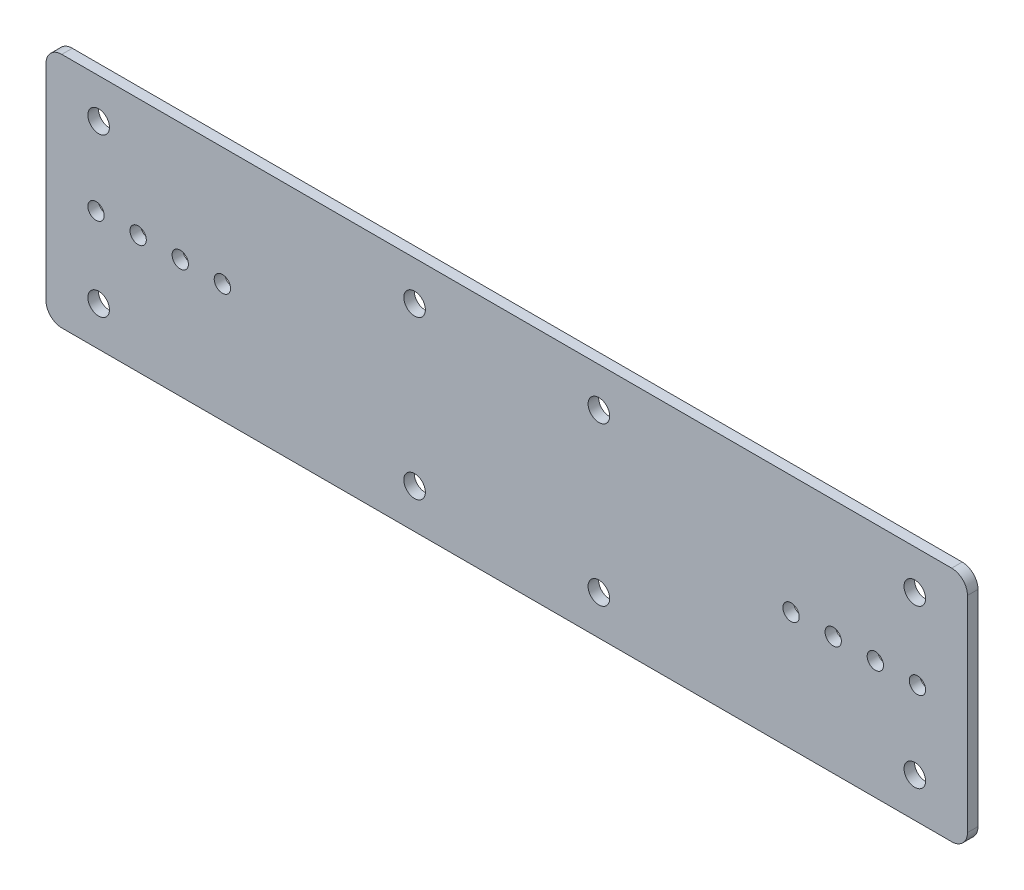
from build123d import *

# Parameters (mm, degrees)
SKETCH_1_W          = 320
SKETCH_1_H          = 45
SKETCH_1_R          = 2.05
EXTRUDE_1_DEPTH     = 2
SKETCH_3_W          = 356.595091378
SKETCH_3_H          = 107.344735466
SKETCH_3_W_2        = 175
SKETCH_3_H_2        = 45
CUT_EXTRUDE_1_DEPTH = 10
SKETCH_4_R          = 1.55
CUT_EXTRUDE_2_DEPTH = 10
FILLET_1_R          = 3


with BuildPart() as part:
    # Sketch 1 → Extrude 1 (new body)
    with BuildSketch(Plane.XY):
        Rectangle(SKETCH_1_W, SKETCH_1_H)
        with Locations((-17.5, 15)):
            Circle(SKETCH_1_R, mode=Mode.SUBTRACT)
        with Locations((17.5, 15)):
            Circle(SKETCH_1_R, mode=Mode.SUBTRACT)
        with Locations((17.5, -15)):
            Circle(SKETCH_1_R, mode=Mode.SUBTRACT)
        with Locations((-17.5, -15)):
            Circle(SKETCH_1_R, mode=Mode.SUBTRACT)
        with Locations((-150.5, 15)):
            Circle(SKETCH_1_R, mode=Mode.SUBTRACT)
        with Locations((-135.5, 15)):
            Circle(SKETCH_1_R, mode=Mode.SUBTRACT)
        with Locations((-135.5, -15)):
            Circle(SKETCH_1_R, mode=Mode.SUBTRACT)
        with Locations((-150.5, -15)):
            Circle(SKETCH_1_R, mode=Mode.SUBTRACT)
        with Locations(Location((150.5, 15, 0), (0, 0, 180))):
            Circle(SKETCH_1_R, mode=Mode.SUBTRACT)
        with Locations(Location((150.5, -15, 0), (0, 0, 180))):
            Circle(SKETCH_1_R, mode=Mode.SUBTRACT)
        with Locations(Location((135.5, -15, 0), (0, 0, 180))):
            Circle(SKETCH_1_R, mode=Mode.SUBTRACT)
        with Locations(Location((135.5, 15, 0), (0, 0, 180))):
            Circle(SKETCH_1_R, mode=Mode.SUBTRACT)
        with Locations((-77.5, 15)):
            Circle(SKETCH_1_R, mode=Mode.SUBTRACT)
        with Locations((-77.5, -15)):
            Circle(SKETCH_1_R, mode=Mode.SUBTRACT)
        with Locations(Location((77.5, -15, 0), (0, 0, 180))):
            Circle(SKETCH_1_R, mode=Mode.SUBTRACT)
        with Locations(Location((77.5, 15, 0), (0, 0, 180))):
            Circle(SKETCH_1_R, mode=Mode.SUBTRACT)
    extrude(amount=EXTRUDE_1_DEPTH)

    # Sketch 3 → Cut-Extrude 1 (cut)
    with BuildSketch(Plane.XY.offset(2)):
        with Locations((-2.960345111, 1.08910621)):
            Rectangle(SKETCH_3_W, SKETCH_3_H)
        Rectangle(SKETCH_3_W_2, SKETCH_3_H_2, mode=Mode.SUBTRACT)
    extrude(amount=-CUT_EXTRUDE_1_DEPTH, mode=Mode.SUBTRACT)

    # Sketch 4 → Cut-Extrude 2 (cut)
    with BuildSketch(Plane.XY.offset(2)):
        with Locations((-78, 0)):
            Circle(SKETCH_4_R)
        with Locations((-70, 0)):
            Circle(SKETCH_4_R)
        with Locations((-62, 0)):
            Circle(SKETCH_4_R)
        with Locations((-54, 0)):
            Circle(SKETCH_4_R)
        with Locations((54, 0)):
            Circle(SKETCH_4_R)
        with Locations((62, 0)):
            Circle(SKETCH_4_R)
        with Locations((70, 0)):
            Circle(SKETCH_4_R)
        with Locations((78, 0)):
            Circle(SKETCH_4_R)
    extrude(amount=-CUT_EXTRUDE_2_DEPTH, mode=Mode.SUBTRACT)

    # Fillet 1
    fillet_1_edges = [part.edges().sort_by_distance(p)[0] for p in [
        (87.5, -22.5, 1),
        (-87.5, -22.5, 1),
        (-87.5, 22.5, 1),
        (87.5, 22.5, 1),
    ]]
    fillet(fillet_1_edges, radius=FILLET_1_R)


solid = part.part
